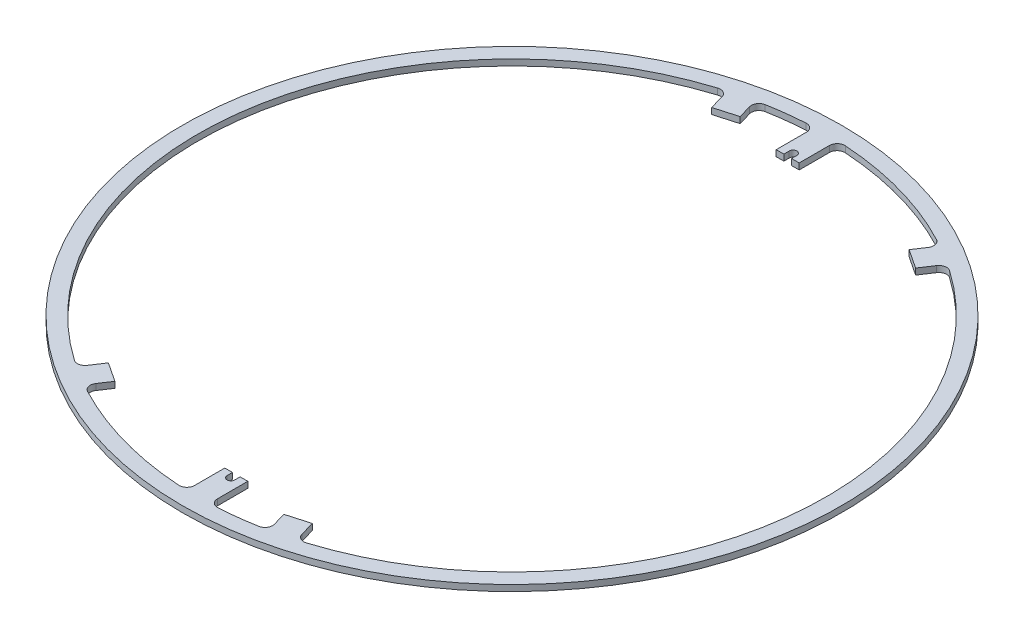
from build123d import *

# Parameters (mm, degrees)
SKETCH_1_R          = 43
SKETCH_1_R_2        = 41
EXTRUDE_1_DEPTH     = 0.8
EXTRUDE_START       = -0.8
EXTRUDE_2_DEPTH     = 0.8
FILLET_1_R          = 1
FILLET_2_R          = 1
CUT_EXTRUDE_1_DEPTH = 61.816445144
EXTRUDE_3_DEPTH     = 0.8
FILLET_3_R          = 1
EXTRUDE_4_DEPTH     = 0.8
FILLET_4_R          = 1


with BuildPart() as part:
    # Sketch 1 → Extrude 1 (new body)
    with BuildSketch(Plane(origin=(0, 0, 0), x_dir=(1, 0, 0), z_dir=(0, 1, 0))):
        with Locations(Location((0, 0, 0), (0, 0, 270))):
            Circle(SKETCH_1_R)
        with Locations(Location((0, 0, 0), (0, 0, 270))):
            Circle(SKETCH_1_R_2, mode=Mode.SUBTRACT)
    extrude(amount=EXTRUDE_1_DEPTH)

    # Sketch 2 → Extrude 2 (add)
    with BuildSketch(Plane(origin=(0, 0.8, 0), x_dir=(1, 0, 0), z_dir=(0, 1, 0)).offset(EXTRUDE_START)):
        with BuildLine():
            Line((-1.5, -35.972551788), (-1.5, -40.972551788))
            ThreePointArc((-1.5, -40.972551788), (0, -41), (1.5, -40.972551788))
            Line((1.5, -40.972551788), (1.5, -35.972551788))
            Line((1.5, -35.972551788), (-1.5, -35.972551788))
        make_face()
        with BuildLine():
            ThreePointArc((1.5, 40.972551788), (0, 41), (-1.5, 40.972551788))
            Line((-1.5, 40.972551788), (-1.5, 35.972551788))
            Line((-1.5, 35.972551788), (1.5, 35.972551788))
            Line((1.5, 35.972551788), (1.5, 40.972551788))
        make_face()
    extrude(amount=EXTRUDE_2_DEPTH)

    # Fillet 1
    fillet_1_edges = [part.edges().sort_by_distance(p)[0] for p in [
        (-1.5, 0.4, -40.972551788),
        (1.5, 0.4, -40.972551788),
    ]]
    fillet(fillet_1_edges, radius=FILLET_1_R)

    # Fillet 2
    fillet_2_edges = [part.edges().sort_by_distance(p)[0] for p in [
        (-1.5, 0.4, 40.972551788),
        (1.5, 0.4, 40.972551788),
    ]]
    fillet(fillet_2_edges, radius=FILLET_2_R)

    # Sketch 3 → Cut-Extrude 1 (cut, through all)
    with BuildSketch(Plane.XZ):
        with BuildLine():
            Line((-0.5, 36.672551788), (-0.5, 33.672551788))
            Line((-0.5, 33.672551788), (0.5, 33.672551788))
            Line((0.5, 33.672551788), (0.5, 36.672551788))
            ThreePointArc((0.5, 36.672551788), (0, 37.172551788), (-0.5, 36.672551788))
        make_face()
        with BuildLine():
            Line((0.5, -33.672551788), (0.5, -36.672551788))
            ThreePointArc((0.5, -36.672551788), (0, -37.172551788), (-0.5, -36.672551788))
            Line((-0.5, -36.672551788), (-0.5, -33.672551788))
            Line((-0.5, -33.672551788), (0.5, -33.672551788))
        make_face()
    extrude(amount=-CUT_EXTRUDE_1_DEPTH, mode=Mode.SUBTRACT)

    # Sketch 4 → Extrude 3 (add)
    with BuildSketch(Plane(origin=(0, 0.8, 0), x_dir=(1, 0, 0), z_dir=(0, 1, 0)).offset(EXTRUDE_START)):
        with BuildLine():
            Line((-22.629416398, -34.189318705), (-20.973605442, -31.687661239))
            Line((-20.973605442, -31.687661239), (-18.471947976, -33.343472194))
            Line((-18.471947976, -33.343472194), (-20.067099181, -35.753482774))
            ThreePointArc((-20.067099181, -35.753482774), (-21.362578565, -34.994860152), (-22.629416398, -34.189318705))
        make_face()
        with BuildLine():
            Line((22.629416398, 34.189318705), (20.973605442, 31.687661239))
            Line((20.973605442, 31.687661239), (18.471947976, 33.343472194))
            Line((18.471947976, 33.343472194), (20.067099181, 35.753482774))
            ThreePointArc((20.067099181, 35.753482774), (21.362578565, 34.994860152), (22.629416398, 34.189318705))
        make_face()
    extrude(amount=EXTRUDE_3_DEPTH)

    # Fillet 3
    fillet_3_edges = [part.edges().sort_by_distance(p)[0] for p in [
        (-20.067099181, 0.4, 35.753482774),
        (-22.629416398, 0.4, 34.189318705),
        (20.067099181, 0.4, -35.753482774),
        (22.629416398, 0.4, -34.189318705),
    ]]
    fillet(fillet_3_edges, radius=FILLET_3_R)

    # Sketch 5 → Extrude 4 (add)
    with BuildSketch(Plane.XZ):
        with BuildLine():
            Line((11.301131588, 39.411729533), (10.474219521, 36.527944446))
            Line((10.474219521, 36.527944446), (7.590434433, 37.354856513))
            Line((7.590434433, 37.354856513), (8.387053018, 40.132995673))
            ThreePointArc((8.387053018, 40.132995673), (9.850695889, 39.799042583), (11.301131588, 39.411729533))
        make_face()
        with BuildLine():
            Line((-7.590434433, -37.354856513), (-8.387053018, -40.132995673))
            ThreePointArc((-8.387053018, -40.132995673), (-9.850695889, -39.799042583), (-11.301131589, -39.411729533))
            Line((-11.301131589, -39.411729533), (-10.474219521, -36.527944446))
            Line((-10.474219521, -36.527944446), (-7.590434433, -37.354856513))
        make_face()
    extrude(amount=-EXTRUDE_4_DEPTH)

    # Fillet 4
    fillet_4_edges = [part.edges().sort_by_distance(p)[0] for p in [
        (11.301131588, 0.4, 39.411729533),
        (8.387053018, 0.4, 40.132995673),
        (-11.301131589, 0.4, -39.411729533),
        (-8.387053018, 0.4, -40.132995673),
    ]]
    fillet(fillet_4_edges, radius=FILLET_4_R)


solid = part.part
